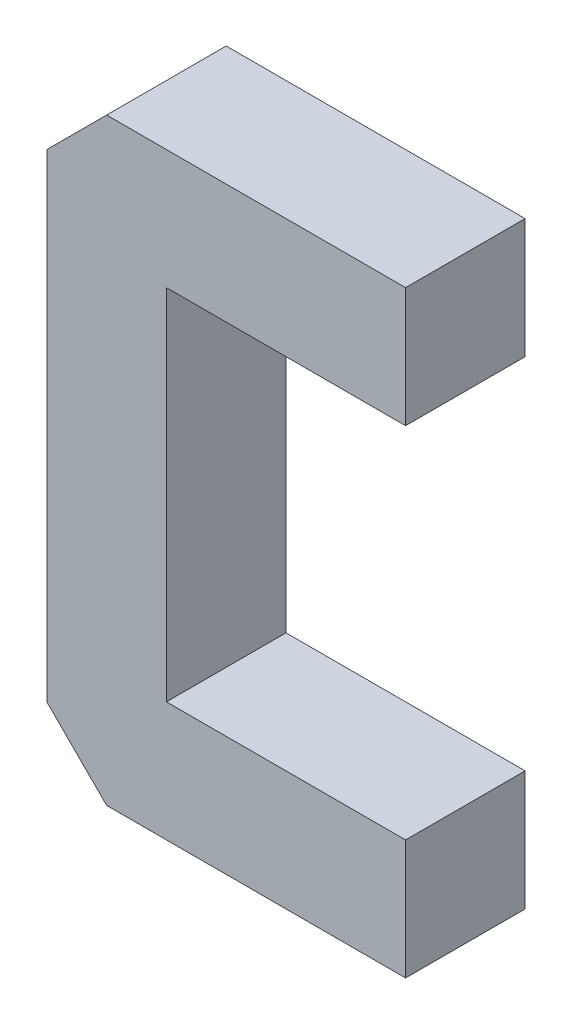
ISO-10303-21;
HEADER;
FILE_DESCRIPTION(('STEP AP214'),'2;1');
FILE_NAME('part.step','',(''),(''),'','','');
FILE_SCHEMA(('AUTOMOTIVE_DESIGN { 1 0 10303 214 1 1 1 1 }'));
ENDSEC;
DATA;
#1=APPLICATION_CONTEXT('core data for automotive mechanical design processes');
#2=APPLICATION_PROTOCOL_DEFINITION('international standard','automotive_design',2000,#1);
#3=PRODUCT_CONTEXT('',#1,'mechanical');
#4=PRODUCT('Part','Part','',(#3));
#5=PRODUCT_RELATED_PRODUCT_CATEGORY('part','',(#4));
#6=PRODUCT_DEFINITION_FORMATION('','',#4);
#7=PRODUCT_DEFINITION_CONTEXT('part definition',#1,'design');
#8=PRODUCT_DEFINITION('design','',#6,#7);
#9=PRODUCT_DEFINITION_SHAPE('','',#8);
#10=(LENGTH_UNIT() NAMED_UNIT(*) SI_UNIT(.MILLI.,.METRE.));
#11=(NAMED_UNIT(*) PLANE_ANGLE_UNIT() SI_UNIT($,.RADIAN.));
#12=(NAMED_UNIT(*) SI_UNIT($,.STERADIAN.) SOLID_ANGLE_UNIT());
#13=UNCERTAINTY_MEASURE_WITH_UNIT(LENGTH_MEASURE(1.E-05),#10,'distance_accuracy_value','');
#14=(GEOMETRIC_REPRESENTATION_CONTEXT(3) GLOBAL_UNCERTAINTY_ASSIGNED_CONTEXT((#13)) GLOBAL_UNIT_ASSIGNED_CONTEXT((#10,
#11,#12)) REPRESENTATION_CONTEXT('',''));
#15=CARTESIAN_POINT('',(0.,0.,0.));
#16=DIRECTION('',(0.,0.,1.));
#17=DIRECTION('',(1.,0.,0.));
#18=AXIS2_PLACEMENT_3D('',#15,#16,#17);
#19=CARTESIAN_POINT('',(0.,0.,10.));
#20=DIRECTION('',(1.,0.,0.));
#21=DIRECTION('',(0.,0.,-1.));
#22=AXIS2_PLACEMENT_3D('',#19,#20,#21);
#23=PLANE('',#22);
#24=DIRECTION('',(0.,-1.,0.));
#25=VECTOR('',#24,1.);
#26=CARTESIAN_POINT('',(0.,0.,0.));
#27=LINE('',#26,#25);
#28=CARTESIAN_POINT('',(0.,45.,0.));
#29=VERTEX_POINT('',#28);
#30=CARTESIAN_POINT('',(0.,5.00000000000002,0.));
#31=VERTEX_POINT('',#30);
#32=EDGE_CURVE('E150',#29,#31,#27,.T.);
#33=ORIENTED_EDGE('',*,*,#32,.T.);
#34=DIRECTION('',(0.,0.,1.));
#35=VECTOR('',#34,1.);
#36=CARTESIAN_POINT('',(0.,5.00000000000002,10.));
#37=LINE('',#36,#35);
#38=CARTESIAN_POINT('',(0.,5.00000000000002,10.));
#39=VERTEX_POINT('',#38);
#40=EDGE_CURVE('E54',#31,#39,#37,.T.);
#41=ORIENTED_EDGE('',*,*,#40,.T.);
#42=DIRECTION('',(0.,-1.,0.));
#43=VECTOR('',#42,1.);
#44=CARTESIAN_POINT('',(0.,0.,10.));
#45=LINE('',#44,#43);
#46=CARTESIAN_POINT('',(0.,45.,10.));
#47=VERTEX_POINT('',#46);
#48=EDGE_CURVE('E121',#47,#39,#45,.T.);
#49=ORIENTED_EDGE('',*,*,#48,.F.);
#50=DIRECTION('',(0.,0.,-1.));
#51=VECTOR('',#50,1.);
#52=CARTESIAN_POINT('',(0.,45.,10.));
#53=LINE('',#52,#51);
#54=EDGE_CURVE('E182',#47,#29,#53,.T.);
#55=ORIENTED_EDGE('',*,*,#54,.T.);
#56=EDGE_LOOP('',(#33,#41,#49,#55));
#57=FACE_BOUND('',#56,.T.);
#58=ADVANCED_FACE('F33',(#57),#23,.F.);
#59=CARTESIAN_POINT('',(0.,0.,10.));
#60=DIRECTION('',(0.,1.,0.));
#61=DIRECTION('',(0.,0.,1.));
#62=AXIS2_PLACEMENT_3D('',#59,#60,#61);
#63=PLANE('',#62);
#64=DIRECTION('',(1.,0.,0.));
#65=VECTOR('',#64,1.);
#66=CARTESIAN_POINT('',(0.,0.,10.));
#67=LINE('',#66,#65);
#68=CARTESIAN_POINT('',(5.,0.,10.));
#69=VERTEX_POINT('',#68);
#70=CARTESIAN_POINT('',(30.,0.,10.));
#71=VERTEX_POINT('',#70);
#72=EDGE_CURVE('E111',#69,#71,#67,.T.);
#73=ORIENTED_EDGE('',*,*,#72,.F.);
#74=DIRECTION('',(0.,0.,-1.));
#75=VECTOR('',#74,1.);
#76=CARTESIAN_POINT('',(5.,0.,10.));
#77=LINE('',#76,#75);
#78=CARTESIAN_POINT('',(5.,0.,0.));
#79=VERTEX_POINT('',#78);
#80=EDGE_CURVE('E130',#69,#79,#77,.T.);
#81=ORIENTED_EDGE('',*,*,#80,.T.);
#82=DIRECTION('',(1.,0.,0.));
#83=VECTOR('',#82,1.);
#84=CARTESIAN_POINT('',(0.,0.,0.));
#85=LINE('',#84,#83);
#86=CARTESIAN_POINT('',(30.,0.,0.));
#87=VERTEX_POINT('',#86);
#88=EDGE_CURVE('E127',#79,#87,#85,.T.);
#89=ORIENTED_EDGE('',*,*,#88,.T.);
#90=DIRECTION('',(0.,0.,-1.));
#91=VECTOR('',#90,1.);
#92=CARTESIAN_POINT('',(30.,0.,10.));
#93=LINE('',#92,#91);
#94=EDGE_CURVE('E124',#71,#87,#93,.T.);
#95=ORIENTED_EDGE('',*,*,#94,.F.);
#96=EDGE_LOOP('',(#73,#81,#89,#95));
#97=FACE_BOUND('',#96,.T.);
#98=ADVANCED_FACE('F125',(#97),#63,.F.);
#99=CARTESIAN_POINT('',(30.,0.,10.));
#100=DIRECTION('',(-1.,0.,0.));
#101=DIRECTION('',(0.,-1.,0.));
#102=AXIS2_PLACEMENT_3D('',#99,#100,#101);
#103=PLANE('',#102);
#104=DIRECTION('',(0.,1.,0.));
#105=VECTOR('',#104,1.);
#106=CARTESIAN_POINT('',(30.,0.,0.));
#107=LINE('',#106,#105);
#108=CARTESIAN_POINT('',(30.,10.,0.));
#109=VERTEX_POINT('',#108);
#110=EDGE_CURVE('E153',#87,#109,#107,.T.);
#111=ORIENTED_EDGE('',*,*,#110,.T.);
#112=DIRECTION('',(0.,0.,-1.));
#113=VECTOR('',#112,1.);
#114=CARTESIAN_POINT('',(30.,10.,10.));
#115=LINE('',#114,#113);
#116=CARTESIAN_POINT('',(30.,10.,10.));
#117=VERTEX_POINT('',#116);
#118=EDGE_CURVE('E131',#117,#109,#115,.T.);
#119=ORIENTED_EDGE('',*,*,#118,.F.);
#120=DIRECTION('',(0.,1.,0.));
#121=VECTOR('',#120,1.);
#122=CARTESIAN_POINT('',(30.,0.,10.));
#123=LINE('',#122,#121);
#124=EDGE_CURVE('E115',#71,#117,#123,.T.);
#125=ORIENTED_EDGE('',*,*,#124,.F.);
#126=ORIENTED_EDGE('',*,*,#94,.T.);
#127=EDGE_LOOP('',(#111,#119,#125,#126));
#128=FACE_BOUND('',#127,.T.);
#129=ADVANCED_FACE('F133',(#128),#103,.F.);
#130=CARTESIAN_POINT('',(30.,10.,10.));
#131=DIRECTION('',(0.,-1.,0.));
#132=DIRECTION('',(1.,0.,0.));
#133=AXIS2_PLACEMENT_3D('',#130,#131,#132);
#134=PLANE('',#133);
#135=DIRECTION('',(-1.,0.,0.));
#136=VECTOR('',#135,1.);
#137=CARTESIAN_POINT('',(30.,10.,0.));
#138=LINE('',#137,#136);
#139=CARTESIAN_POINT('',(10.,10.,0.));
#140=VERTEX_POINT('',#139);
#141=EDGE_CURVE('E155',#109,#140,#138,.T.);
#142=ORIENTED_EDGE('',*,*,#141,.T.);
#143=DIRECTION('',(0.,0.,-1.));
#144=VECTOR('',#143,1.);
#145=CARTESIAN_POINT('',(10.,10.,10.));
#146=LINE('',#145,#144);
#147=CARTESIAN_POINT('',(10.,10.,10.));
#148=VERTEX_POINT('',#147);
#149=EDGE_CURVE('E173',#148,#140,#146,.T.);
#150=ORIENTED_EDGE('',*,*,#149,.F.);
#151=DIRECTION('',(-1.,0.,0.));
#152=VECTOR('',#151,1.);
#153=CARTESIAN_POINT('',(30.,10.,10.));
#154=LINE('',#153,#152);
#155=EDGE_CURVE('E136',#117,#148,#154,.T.);
#156=ORIENTED_EDGE('',*,*,#155,.F.);
#157=ORIENTED_EDGE('',*,*,#118,.T.);
#158=EDGE_LOOP('',(#142,#150,#156,#157));
#159=FACE_BOUND('',#158,.T.);
#160=ADVANCED_FACE('F213',(#159),#134,.F.);
#161=CARTESIAN_POINT('',(10.,40.,10.));
#162=DIRECTION('',(-1.,0.,0.));
#163=DIRECTION('',(0.,-1.,0.));
#164=AXIS2_PLACEMENT_3D('',#161,#162,#163);
#165=PLANE('',#164);
#166=DIRECTION('',(0.,1.,0.));
#167=VECTOR('',#166,1.);
#168=CARTESIAN_POINT('',(10.,40.,0.));
#169=LINE('',#168,#167);
#170=CARTESIAN_POINT('',(10.,40.,0.));
#171=VERTEX_POINT('',#170);
#172=EDGE_CURVE('E157',#140,#171,#169,.T.);
#173=ORIENTED_EDGE('',*,*,#172,.T.);
#174=DIRECTION('',(0.,0.,-1.));
#175=VECTOR('',#174,1.);
#176=CARTESIAN_POINT('',(10.,40.,10.));
#177=LINE('',#176,#175);
#178=CARTESIAN_POINT('',(10.,40.,10.));
#179=VERTEX_POINT('',#178);
#180=EDGE_CURVE('E170',#179,#171,#177,.T.);
#181=ORIENTED_EDGE('',*,*,#180,.F.);
#182=DIRECTION('',(0.,1.,0.));
#183=VECTOR('',#182,1.);
#184=CARTESIAN_POINT('',(10.,40.,10.));
#185=LINE('',#184,#183);
#186=EDGE_CURVE('E138',#148,#179,#185,.T.);
#187=ORIENTED_EDGE('',*,*,#186,.F.);
#188=ORIENTED_EDGE('',*,*,#149,.T.);
#189=EDGE_LOOP('',(#173,#181,#187,#188));
#190=FACE_BOUND('',#189,.T.);
#191=ADVANCED_FACE('F210',(#190),#165,.F.);
#192=CARTESIAN_POINT('',(30.,40.,10.));
#193=DIRECTION('',(0.,1.,0.));
#194=DIRECTION('',(0.,0.,1.));
#195=AXIS2_PLACEMENT_3D('',#192,#193,#194);
#196=PLANE('',#195);
#197=DIRECTION('',(1.,0.,0.));
#198=VECTOR('',#197,1.);
#199=CARTESIAN_POINT('',(30.,40.,0.));
#200=LINE('',#199,#198);
#201=CARTESIAN_POINT('',(30.,40.,0.));
#202=VERTEX_POINT('',#201);
#203=EDGE_CURVE('E159',#171,#202,#200,.T.);
#204=ORIENTED_EDGE('',*,*,#203,.T.);
#205=DIRECTION('',(0.,0.,-1.));
#206=VECTOR('',#205,1.);
#207=CARTESIAN_POINT('',(30.,40.,10.));
#208=LINE('',#207,#206);
#209=CARTESIAN_POINT('',(30.,40.,10.));
#210=VERTEX_POINT('',#209);
#211=EDGE_CURVE('E167',#210,#202,#208,.T.);
#212=ORIENTED_EDGE('',*,*,#211,.F.);
#213=DIRECTION('',(1.,0.,0.));
#214=VECTOR('',#213,1.);
#215=CARTESIAN_POINT('',(30.,40.,10.));
#216=LINE('',#215,#214);
#217=EDGE_CURVE('E143',#179,#210,#216,.T.);
#218=ORIENTED_EDGE('',*,*,#217,.F.);
#219=ORIENTED_EDGE('',*,*,#180,.T.);
#220=EDGE_LOOP('',(#204,#212,#218,#219));
#221=FACE_BOUND('',#220,.T.);
#222=ADVANCED_FACE('F205',(#221),#196,.F.);
#223=CARTESIAN_POINT('',(30.,40.,10.));
#224=DIRECTION('',(-1.,0.,0.));
#225=DIRECTION('',(0.,0.,1.));
#226=AXIS2_PLACEMENT_3D('',#223,#224,#225);
#227=PLANE('',#226);
#228=DIRECTION('',(0.,1.,0.));
#229=VECTOR('',#228,1.);
#230=CARTESIAN_POINT('',(30.,40.,0.));
#231=LINE('',#230,#229);
#232=CARTESIAN_POINT('',(30.,50.,0.));
#233=VERTEX_POINT('',#232);
#234=EDGE_CURVE('E161',#202,#233,#231,.T.);
#235=ORIENTED_EDGE('',*,*,#234,.T.);
#236=DIRECTION('',(0.,0.,-1.));
#237=VECTOR('',#236,1.);
#238=CARTESIAN_POINT('',(30.,50.,10.));
#239=LINE('',#238,#237);
#240=CARTESIAN_POINT('',(30.,50.,10.));
#241=VERTEX_POINT('',#240);
#242=EDGE_CURVE('E149',#241,#233,#239,.T.);
#243=ORIENTED_EDGE('',*,*,#242,.F.);
#244=DIRECTION('',(0.,1.,0.));
#245=VECTOR('',#244,1.);
#246=CARTESIAN_POINT('',(30.,40.,10.));
#247=LINE('',#246,#245);
#248=EDGE_CURVE('E145',#210,#241,#247,.T.);
#249=ORIENTED_EDGE('',*,*,#248,.F.);
#250=ORIENTED_EDGE('',*,*,#211,.T.);
#251=EDGE_LOOP('',(#235,#243,#249,#250));
#252=FACE_BOUND('',#251,.T.);
#253=ADVANCED_FACE('F199',(#252),#227,.F.);
#254=CARTESIAN_POINT('',(0.,50.,10.));
#255=DIRECTION('',(0.,-1.,0.));
#256=DIRECTION('',(0.,0.,-1.));
#257=AXIS2_PLACEMENT_3D('',#254,#255,#256);
#258=PLANE('',#257);
#259=DIRECTION('',(-1.,0.,0.));
#260=VECTOR('',#259,1.);
#261=CARTESIAN_POINT('',(0.,50.,0.));
#262=LINE('',#261,#260);
#263=CARTESIAN_POINT('',(5.00000000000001,50.,0.));
#264=VERTEX_POINT('',#263);
#265=EDGE_CURVE('E163',#233,#264,#262,.T.);
#266=ORIENTED_EDGE('',*,*,#265,.T.);
#267=DIRECTION('',(0.,0.,1.));
#268=VECTOR('',#267,1.);
#269=CARTESIAN_POINT('',(5.00000000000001,50.,10.));
#270=LINE('',#269,#268);
#271=CARTESIAN_POINT('',(5.00000000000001,50.,10.));
#272=VERTEX_POINT('',#271);
#273=EDGE_CURVE('E11',#264,#272,#270,.T.);
#274=ORIENTED_EDGE('',*,*,#273,.T.);
#275=DIRECTION('',(-1.,0.,0.));
#276=VECTOR('',#275,1.);
#277=CARTESIAN_POINT('',(0.,50.,10.));
#278=LINE('',#277,#276);
#279=EDGE_CURVE('E147',#241,#272,#278,.T.);
#280=ORIENTED_EDGE('',*,*,#279,.F.);
#281=ORIENTED_EDGE('',*,*,#242,.T.);
#282=EDGE_LOOP('',(#266,#274,#280,#281));
#283=FACE_BOUND('',#282,.T.);
#284=ADVANCED_FACE('F195',(#283),#258,.F.);
#285=CARTESIAN_POINT('',(0.,0.,10.));
#286=DIRECTION('',(0.,0.,-1.));
#287=DIRECTION('',(-1.,0.,0.));
#288=AXIS2_PLACEMENT_3D('',#285,#286,#287);
#289=PLANE('',#288);
#290=ORIENTED_EDGE('',*,*,#48,.T.);
#291=DIRECTION('',(-0.707106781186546,0.707106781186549,0.));
#292=VECTOR('',#291,1.);
#293=CARTESIAN_POINT('',(5.,0.,10.));
#294=LINE('',#293,#292);
#295=EDGE_CURVE('E41',#39,#69,#294,.F.);
#296=ORIENTED_EDGE('',*,*,#295,.T.);
#297=ORIENTED_EDGE('',*,*,#72,.T.);
#298=ORIENTED_EDGE('',*,*,#124,.T.);
#299=ORIENTED_EDGE('',*,*,#155,.T.);
#300=ORIENTED_EDGE('',*,*,#186,.T.);
#301=ORIENTED_EDGE('',*,*,#217,.T.);
#302=ORIENTED_EDGE('',*,*,#248,.T.);
#303=ORIENTED_EDGE('',*,*,#279,.T.);
#304=DIRECTION('',(0.707106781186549,0.707106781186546,0.));
#305=VECTOR('',#304,1.);
#306=CARTESIAN_POINT('',(0.,45.,10.));
#307=LINE('',#306,#305);
#308=EDGE_CURVE('E186',#272,#47,#307,.F.);
#309=ORIENTED_EDGE('',*,*,#308,.T.);
#310=EDGE_LOOP('',(#290,#296,#297,#298,#299,#300,#301,#302,#303,#309));
#311=FACE_BOUND('',#310,.T.);
#312=ADVANCED_FACE('F113',(#311),#289,.F.);
#313=CARTESIAN_POINT('',(0.,0.,0.));
#314=DIRECTION('',(0.,0.,-1.));
#315=DIRECTION('',(-1.,0.,0.));
#316=AXIS2_PLACEMENT_3D('',#313,#314,#315);
#317=PLANE('',#316);
#318=ORIENTED_EDGE('',*,*,#88,.F.);
#319=DIRECTION('',(0.707106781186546,-0.707106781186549,0.));
#320=VECTOR('',#319,1.);
#321=CARTESIAN_POINT('',(2.50000000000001,2.5,0.));
#322=LINE('',#321,#320);
#323=EDGE_CURVE('E180',#79,#31,#322,.F.);
#324=ORIENTED_EDGE('',*,*,#323,.T.);
#325=ORIENTED_EDGE('',*,*,#32,.F.);
#326=DIRECTION('',(-0.707106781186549,-0.707106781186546,0.));
#327=VECTOR('',#326,1.);
#328=CARTESIAN_POINT('',(-22.5,22.5000000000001,0.));
#329=LINE('',#328,#327);
#330=EDGE_CURVE('E178',#29,#264,#329,.F.);
#331=ORIENTED_EDGE('',*,*,#330,.T.);
#332=ORIENTED_EDGE('',*,*,#265,.F.);
#333=ORIENTED_EDGE('',*,*,#234,.F.);
#334=ORIENTED_EDGE('',*,*,#203,.F.);
#335=ORIENTED_EDGE('',*,*,#172,.F.);
#336=ORIENTED_EDGE('',*,*,#141,.F.);
#337=ORIENTED_EDGE('',*,*,#110,.F.);
#338=EDGE_LOOP('',(#318,#324,#325,#331,#332,#333,#334,#335,#336,#337));
#339=FACE_BOUND('',#338,.T.);
#340=ADVANCED_FACE('F193',(#339),#317,.T.);
#341=CARTESIAN_POINT('',(5.,0.,10.));
#342=DIRECTION('',(0.707106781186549,0.707106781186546,0.));
#343=DIRECTION('',(0.,0.,-1.));
#344=AXIS2_PLACEMENT_3D('',#341,#342,#343);
#345=PLANE('',#344);
#346=ORIENTED_EDGE('',*,*,#295,.F.);
#347=ORIENTED_EDGE('',*,*,#40,.F.);
#348=ORIENTED_EDGE('',*,*,#323,.F.);
#349=ORIENTED_EDGE('',*,*,#80,.F.);
#350=EDGE_LOOP('',(#346,#347,#348,#349));
#351=FACE_BOUND('',#350,.T.);
#352=ADVANCED_FACE('F215',(#351),#345,.F.);
#353=CARTESIAN_POINT('',(0.,45.,10.));
#354=DIRECTION('',(0.707106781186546,-0.707106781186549,0.));
#355=DIRECTION('',(0.,0.,-1.));
#356=AXIS2_PLACEMENT_3D('',#353,#354,#355);
#357=PLANE('',#356);
#358=ORIENTED_EDGE('',*,*,#308,.F.);
#359=ORIENTED_EDGE('',*,*,#273,.F.);
#360=ORIENTED_EDGE('',*,*,#330,.F.);
#361=ORIENTED_EDGE('',*,*,#54,.F.);
#362=EDGE_LOOP('',(#358,#359,#360,#361));
#363=FACE_BOUND('',#362,.T.);
#364=ADVANCED_FACE('F35',(#363),#357,.F.);
#365=CLOSED_SHELL('',(#58,#98,#129,#160,#191,#222,#253,#284,#312,#340,#352,#364));
#366=MANIFOLD_SOLID_BREP('B2',#365);
#367=ADVANCED_BREP_SHAPE_REPRESENTATION('',(#18,#366),#14);
#368=SHAPE_DEFINITION_REPRESENTATION(#9,#367);
ENDSEC;
END-ISO-10303-21;
